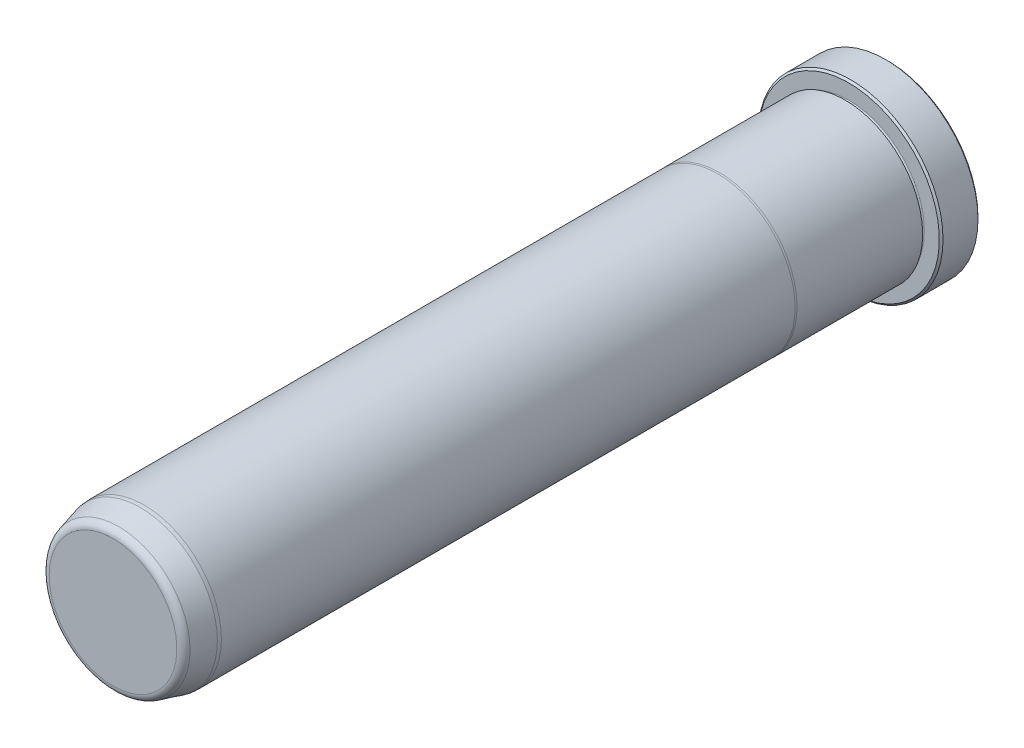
from build123d import *

# Parameters (mm, degrees)
FILLET6_R     = 1.5875
CHAMFER1_SIZE = 0.381


with BuildPart() as part:
    # Sketch1 → Revolve1 (revolve)
    with BuildSketch(Plane(origin=(0, 0, 0), x_dir=(0, 0, -1), z_dir=(1, 0, 0)), mode=Mode.PRIVATE) as revolve1_sk:
        with BuildLine():
            Line((0, 0), (0, 18.923))
            Line((0, 18.923), (-7.9248, 18.923))
            Line((-7.9248, 18.923), (-7.9248, 15.4813))
            ThreePointArc((-7.9248, 15.4813), (-8.3058, 15.1003), (-8.6868, 15.4813))
            Line((-8.6868, 15.4813), (-8.6868, 15.8877))
            Line((-8.6868, 15.8877), (-34.434763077, 15.8877))
            Line((-34.434763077, 15.8877), (-34.798, 15.8623))
            Line((-34.798, 15.8623), (-152.4, 15.8623))
            Line((-152.4, 15.8623), (-153.162, 15.795633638))
            Line((-153.162, 15.795633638), (-158.75, 14.298333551))
            Line((-158.75, 14.298333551), (-158.75, 0))
            Line((-158.75, 0), (0, 0))
        make_face()
    revolve(revolve1_sk.sketch.rotate(Axis((0, 0, 0), (0, 0, -1)), 90), axis=Axis((0, 0, 0), (0, 0, -1)))

    # Fillet6
    fillet6_edges = [part.edges().sort_by_distance(p)[0] for p in [
        (-14.298333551, 0, 158.75),
    ]]
    fillet(fillet6_edges, radius=FILLET6_R)

    # Chamfer1
    chamfer1_edges = [part.edges().sort_by_distance(p)[0] for p in [
        (-18.923, 0, 7.9248),
        (-18.923, 0, 0),
    ]]
    chamfer(chamfer1_edges, length=CHAMFER1_SIZE)


solid = part.part
